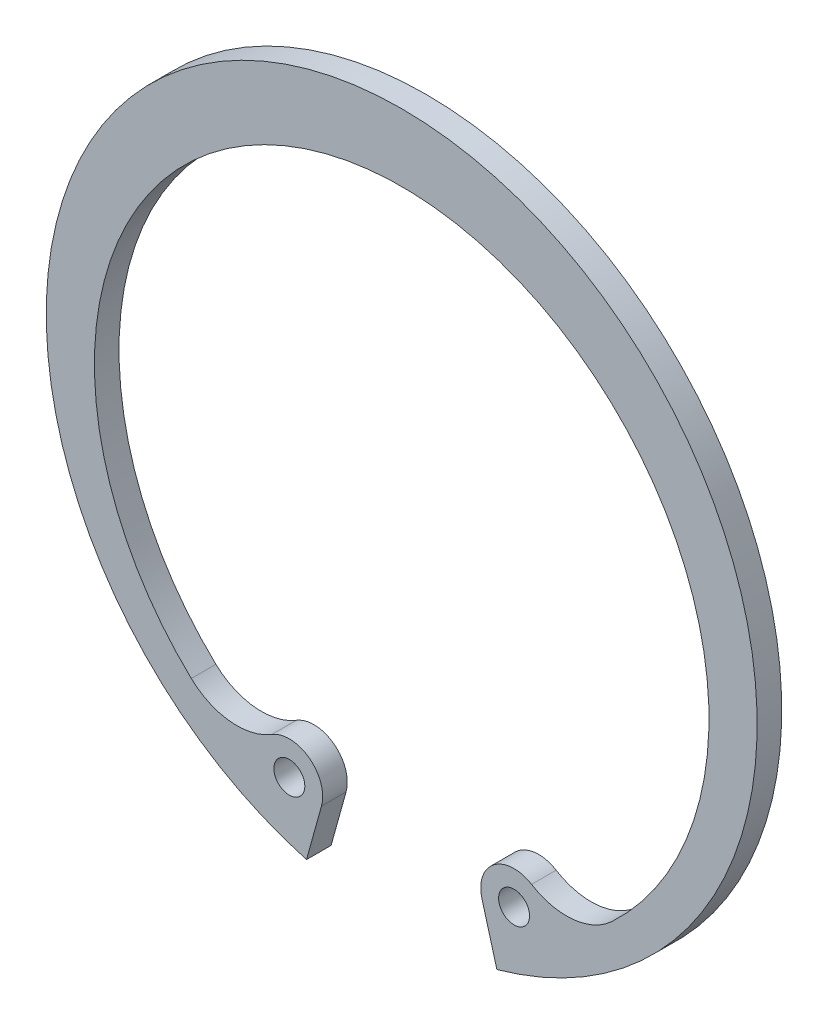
from build123d import *

# Parameters (mm, degrees)
BODYSKE_R  = 0.9906
BODY_DEPTH = 1.5748


with BuildPart() as part:
    # BodySke → Body (new body)
    with BuildSketch(Plane.XY):
        with BuildLine():
            Line((6.094561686, -21.927176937), (5.137821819, -18.48499267))
            ThreePointArc((5.137821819, -18.48499267), (5.910662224, -16.208755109), (8.311906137, -16.096650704))
            ThreePointArc((8.311906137, -16.096650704), (10.979838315, -16.708064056), (13.470400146, -15.572815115))
            ThreePointArc((13.470400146, -15.572815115), (0, 18.4404), (-13.470400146, -15.572815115))
            ThreePointArc((-13.470400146, -15.572815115), (-10.979838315, -16.708064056), (-8.311906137, -16.096650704))
            ThreePointArc((-8.311906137, -16.096650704), (-5.910662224, -16.208755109), (-5.137821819, -18.48499267))
            Line((-5.137821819, -18.48499267), (-6.094561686, -21.927176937))
            ThreePointArc((-6.094561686, -21.927176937), (0, 22.7584), (6.094561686, -21.927176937))
        make_face()
        with Locations((7.193494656, -17.913627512)):
            Circle(BODYSKE_R, mode=Mode.SUBTRACT)
        with Locations((-7.193494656, -17.913627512)):
            Circle(BODYSKE_R, mode=Mode.SUBTRACT)
    extrude(amount=-BODY_DEPTH)


solid = part.part
